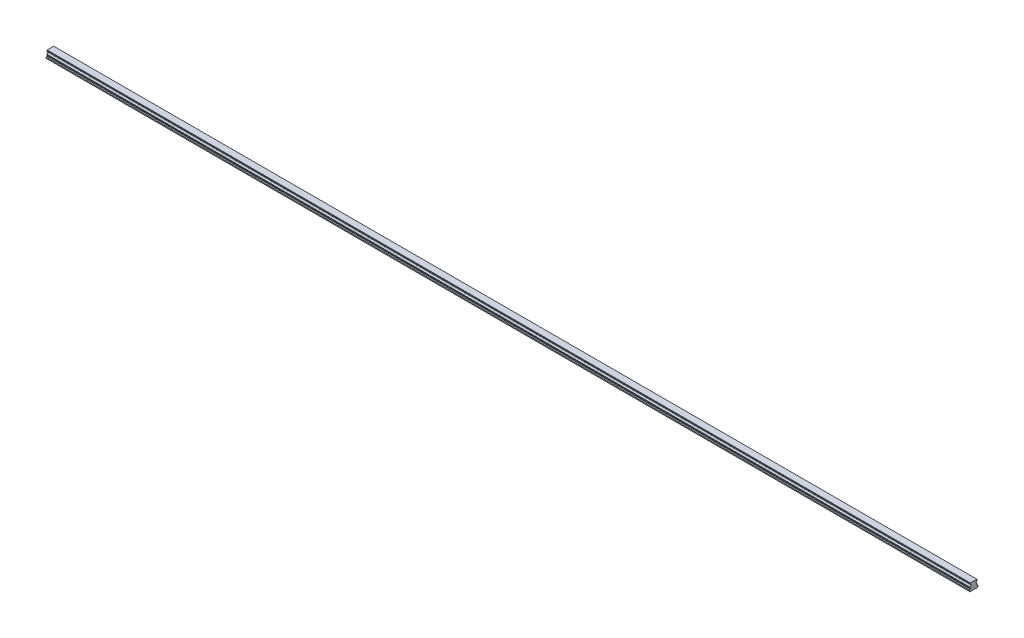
from build123d import *

# Parameters (mm, degrees)
BOSS_EXTRUDE1_DEPTH        = 2640
SKETCH3_R                  = 3
SKETCH3_R_2                = 2.5
CUT_EXTRUDE3_DEPTH         = 12
SKETCH3_2_R                = 2.5
CUT_EXTRUDE4_DEPTH         = 15
CHAMFER1_SIZE              = 0.5
LPATTERN4_COUNT            = 44
LPATTERN4_PITCH            = 60
CHAMFER1_OF_LPATTERN4_SIZE = 0.5


with BuildPart() as part:
    # Sketch1 → Boss-Extrude1 (new body)
    with BuildSketch(Plane(origin=(0, 0, 0), x_dir=(0, 0, -1), z_dir=(1, 0, 0))):
        with BuildLine():
            Line((9.375, 21.8), (-9.375, 21.8))
            Line((-9.375, 21.8), (-9.375, 20.756))
            Line((-9.375, 20.756), (-10, 19.415683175))
            Line((-10, 19.415683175), (-10, 17.685449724))
            ThreePointArc((-10, 17.685449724), (-7.2, 14.6), (-10, 11.514550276))
            Line((-10, 11.514550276), (-10, 9.784316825))
            Line((-10, 9.784316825), (-9.375, 8.444))
            Line((-9.375, 8.444), (-9.922688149, 6.4))
            Line((-9.922688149, 6.4), (-12.5, 5.489338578))
            Line((-12.5, 5.489338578), (-12.5, 2.65))
            Line((-12.5, 2.65), (-9.85, 0))
            Line((-9.85, 0), (-5.5, 0))
            Line((-5.5, 0), (-5, 0.5))
            Line((-5, 0.5), (5, 0.5))
            Line((5, 0.5), (5.5, 0))
            Line((5.5, 0), (9.85, 0))
            Line((9.85, 0), (12.5, 2.65))
            Line((12.5, 2.65), (12.5, 5.489338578))
            Line((12.5, 5.489338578), (9.922688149, 6.4))
            Line((9.922688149, 6.4), (9.375, 8.444))
            Line((9.375, 8.444), (10, 9.784316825))
            Line((10, 9.784316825), (10, 11.514550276))
            ThreePointArc((10, 11.514550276), (7.2, 14.6), (10, 17.685449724))
            Line((10, 17.685449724), (10, 19.415683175))
            Line((10, 19.415683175), (9.375, 20.756))
            Line((9.375, 20.756), (9.375, 21.8))
        make_face()
    extrude(amount=BOSS_EXTRUDE1_DEPTH)

    # Sketch3 → Cut-Extrude3 (cut)
    with BuildSketch(Plane.XZ):
        with Locations(Location((30, 0, 0), (0, 0, 270))):
            Circle(SKETCH3_R)
        with Locations(Location((30, 0, 0), (0, 0, 270))):
            Circle(SKETCH3_R_2, mode=Mode.SUBTRACT)
    cut_extrude3 = extrude(amount=-CUT_EXTRUDE3_DEPTH, mode=Mode.SUBTRACT)

    # Sketch3_2 → Cut-Extrude4 (cut)
    with BuildSketch(Plane.XZ):
        with Locations(Location((30, 0, 0), (0, 0, 270))):
            Circle(SKETCH3_2_R)
    cut_extrude4 = extrude(amount=-CUT_EXTRUDE4_DEPTH, mode=Mode.SUBTRACT)

    # Cut-Extrude5 cone 1 section (on through the dimple's axis) → Cut-Extrude5 (revolve, cut)
    with BuildSketch(Plane(origin=(30, 15, 0), x_dir=(0, 0, -1), z_dir=(1, 0, 0))):
        Polygon((0, 0), (2.5, 0), (0, 1.443375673), align=None)
    cut_extrude5 = revolve(axis=Axis((30, 15, 0), (0, 1, 0)), mode=Mode.SUBTRACT)

    # Chamfer1
    chamfer1_edges = [part.edges().sort_by_distance(p)[0] for p in [
        (30, 0.5, 3),
    ]]
    chamfer(chamfer1_edges, length=CHAMFER1_SIZE)

    # LPattern4: Cut-Extrude3, Cut-Extrude4, Cut-Extrude5 ×44
    with Locations(*[(i * LPATTERN4_PITCH, 0, 0) for i in range(1, LPATTERN4_COUNT)]):
        add(cut_extrude3, mode=Mode.SUBTRACT)
        add(cut_extrude4, mode=Mode.SUBTRACT)
        add(cut_extrude5, mode=Mode.SUBTRACT)

    # Chamfer1 of LPattern4
    chamfer1_of_lpattern4_edges = [part.edges().sort_by_distance(p)[0] for p in [
        (90, 0.5, 3),
        (150, 0.5, 3),
        (210, 0.5, 3),
        (270, 0.5, 3),
        (330, 0.5, 3),
        (390, 0.5, 3),
        (450, 0.5, 3),
        (510, 0.5, 3),
        (570, 0.5, 3),
        (630, 0.5, 3),
        (690, 0.5, 3),
        (750, 0.5, 3),
        (810, 0.5, 3),
        (870, 0.5, 3),
        (930, 0.5, 3),
        (990, 0.5, 3),
        (1050, 0.5, 3),
        (1110, 0.5, 3),
        (1170, 0.5, 3),
        (1230, 0.5, 3),
        (1290, 0.5, 3),
        (1350, 0.5, 3),
        (1410, 0.5, 3),
        (1470, 0.5, 3),
        (1530, 0.5, 3),
        (1590, 0.5, 3),
        (1650, 0.5, 3),
        (1710, 0.5, 3),
        (1770, 0.5, 3),
        (1830, 0.5, 3),
        (1890, 0.5, 3),
        (1950, 0.5, 3),
        (2010, 0.5, 3),
        (2070, 0.5, 3),
        (2130, 0.5, 3),
        (2190, 0.5, 3),
        (2250, 0.5, 3),
        (2310, 0.5, 3),
        (2370, 0.5, 3),
        (2430, 0.5, 3),
        (2490, 0.5, 3),
        (2550, 0.5, 3),
        (2610, 0.5, 3),
    ]]
    chamfer(chamfer1_of_lpattern4_edges, length=CHAMFER1_OF_LPATTERN4_SIZE)


solid = part.part
